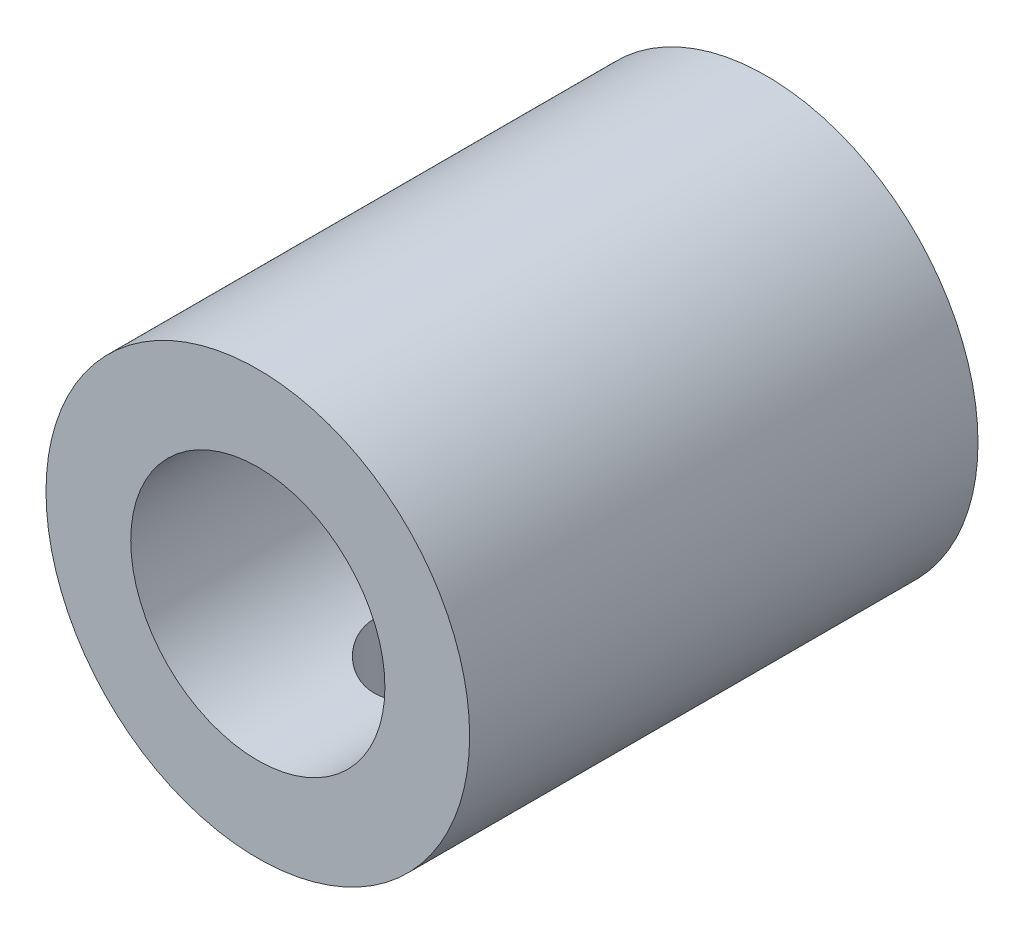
from build123d import *

# Parameters (mm, degrees)
SKETCH_1_R          = 50
SKETCH_1_R_2        = 30
EXTRUDE_1_DEPTH     = 120
SKETCH_2_R          = 12.5
CUT_EXTRUDE_1_DEPTH = 80


with BuildPart() as part:
    # Sketch 1 → Extrude 1 (new body)
    with BuildSketch(Plane.XY):
        Circle(SKETCH_1_R)
        Circle(SKETCH_1_R_2, mode=Mode.SUBTRACT)
    extrude(amount=EXTRUDE_1_DEPTH)

    # Sketch 2 → Cut-Extrude 1 (cut)
    with BuildSketch(Plane(origin=(0, 0, 0), x_dir=(1, 0, 0), z_dir=(0, 1, 0))):
        with Locations(Location((0, -80, 0), (0, 0, 270))):
            Circle(SKETCH_2_R)
    extrude(amount=-CUT_EXTRUDE_1_DEPTH, mode=Mode.SUBTRACT)


solid = part.part
